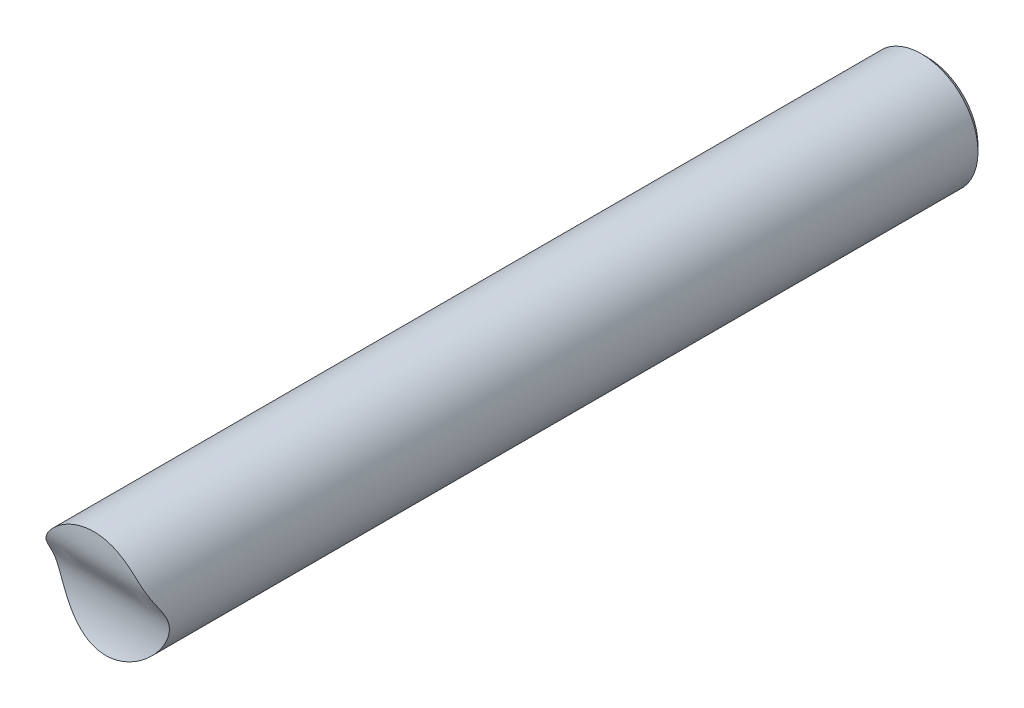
ISO-10303-21;
HEADER;
FILE_DESCRIPTION(('STEP AP214'),'2;1');
FILE_NAME('part.step','',(''),(''),'','','');
FILE_SCHEMA(('AUTOMOTIVE_DESIGN { 1 0 10303 214 1 1 1 1 }'));
ENDSEC;
DATA;
#1=APPLICATION_CONTEXT('core data for automotive mechanical design processes');
#2=APPLICATION_PROTOCOL_DEFINITION('international standard','automotive_design',2000,#1);
#3=PRODUCT_CONTEXT('',#1,'mechanical');
#4=PRODUCT('Part','Part','',(#3));
#5=PRODUCT_RELATED_PRODUCT_CATEGORY('part','',(#4));
#6=PRODUCT_DEFINITION_FORMATION('','',#4);
#7=PRODUCT_DEFINITION_CONTEXT('part definition',#1,'design');
#8=PRODUCT_DEFINITION('design','',#6,#7);
#9=PRODUCT_DEFINITION_SHAPE('','',#8);
#10=(LENGTH_UNIT() NAMED_UNIT(*) SI_UNIT(.MILLI.,.METRE.));
#11=(NAMED_UNIT(*) PLANE_ANGLE_UNIT() SI_UNIT($,.RADIAN.));
#12=(NAMED_UNIT(*) SI_UNIT($,.STERADIAN.) SOLID_ANGLE_UNIT());
#13=UNCERTAINTY_MEASURE_WITH_UNIT(LENGTH_MEASURE(1.E-05),#10,'distance_accuracy_value','');
#14=(GEOMETRIC_REPRESENTATION_CONTEXT(3) GLOBAL_UNCERTAINTY_ASSIGNED_CONTEXT((#13)) GLOBAL_UNIT_ASSIGNED_CONTEXT((#10,
#11,#12)) REPRESENTATION_CONTEXT('',''));
#15=CARTESIAN_POINT('',(0.,0.,0.));
#16=DIRECTION('',(0.,0.,1.));
#17=DIRECTION('',(1.,0.,0.));
#18=AXIS2_PLACEMENT_3D('',#15,#16,#17);
#19=CARTESIAN_POINT('',(0.,0.,300.));
#20=DIRECTION('',(0.,0.,-1.));
#21=DIRECTION('',(-1.,0.,0.));
#22=AXIS2_PLACEMENT_3D('',#19,#20,#21);
#23=CYLINDRICAL_SURFACE('',#22,20.);
#24=CARTESIAN_POINT('',(0.,0.,1.99999999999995));
#25=DIRECTION('',(0.,0.,1.));
#26=DIRECTION('',(1.,0.,0.));
#27=AXIS2_PLACEMENT_3D('',#24,#25,#26);
#28=CIRCLE('',#27,20.);
#29=CARTESIAN_POINT('',(20.,0.,1.99999999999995));
#30=VERTEX_POINT('',#29);
#31=EDGE_CURVE('E39',#30,#30,#28,.T.);
#32=ORIENTED_EDGE('',*,*,#31,.T.);
#33=EDGE_LOOP('',(#32));
#34=FACE_BOUND('',#33,.T.);
#35=CARTESIAN_POINT('',(-20.,0.,288.275015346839));
#36=CARTESIAN_POINT('',(-20.0000030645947,0.381439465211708,288.437177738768));
#37=CARTESIAN_POINT('',(-19.989101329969,0.756285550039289,288.615006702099));
#38=CARTESIAN_POINT('',(-19.9475375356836,1.49424268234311,288.992565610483));
#39=CARTESIAN_POINT('',(-19.9168355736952,1.85732847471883,289.192339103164));
#40=CARTESIAN_POINT('',(-19.83689410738,2.57448567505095,289.604971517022));
#41=CARTESIAN_POINT('',(-19.7876280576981,2.92854339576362,289.817848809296));
#42=CARTESIAN_POINT('',(-19.6705209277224,3.63304827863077,290.250115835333));
#43=CARTESIAN_POINT('',(-19.6025492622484,3.98345138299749,290.469541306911));
#44=CARTESIAN_POINT('',(-19.4477872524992,4.68091347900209,290.9058795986));
#45=CARTESIAN_POINT('',(-19.3610253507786,5.02797670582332,291.122795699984));
#46=CARTESIAN_POINT('',(-19.1674279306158,5.72182737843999,291.547604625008));
#47=CARTESIAN_POINT('',(-19.0606051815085,6.068614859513,291.755503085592));
#48=CARTESIAN_POINT('',(-18.8652706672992,6.64530052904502,292.087795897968));
#49=CARTESIAN_POINT('',(-18.7829107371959,6.87478923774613,292.216517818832));
#50=CARTESIAN_POINT('',(-18.6081795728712,7.33458673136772,292.465618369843));
#51=CARTESIAN_POINT('',(-18.5158062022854,7.56489568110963,292.585995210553));
#52=CARTESIAN_POINT('',(-18.3205880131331,8.02612933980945,292.816780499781));
#53=CARTESIAN_POINT('',(-18.2177421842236,8.25705410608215,292.92718798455));
#54=CARTESIAN_POINT('',(-18.0019283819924,8.71749940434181,293.135953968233));
#55=CARTESIAN_POINT('',(-17.8890305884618,8.94701930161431,293.234386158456));
#56=CARTESIAN_POINT('',(-17.6523312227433,9.40540834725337,293.41896562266));
#57=CARTESIAN_POINT('',(-17.5285299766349,9.63427751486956,293.505113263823));
#58=CARTESIAN_POINT('',(-17.3346823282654,9.97627021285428,293.624584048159));
#59=CARTESIAN_POINT('',(-17.2687173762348,10.0900354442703,293.662778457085));
#60=CARTESIAN_POINT('',(-17.1340735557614,10.3170215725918,293.735886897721));
#61=CARTESIAN_POINT('',(-17.0653945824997,10.4302424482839,293.770800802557));
#62=CARTESIAN_POINT('',(-16.890032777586,10.7129227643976,293.854107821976));
#63=CARTESIAN_POINT('',(-16.7816509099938,10.8819491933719,293.900419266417));
#64=CARTESIAN_POINT('',(-16.5589278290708,11.2179559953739,293.985558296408));
#65=CARTESIAN_POINT('',(-16.4445861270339,11.3849361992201,294.024385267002));
#66=CARTESIAN_POINT('',(-16.2101531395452,11.7163192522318,294.095354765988));
#67=CARTESIAN_POINT('',(-16.0900603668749,11.8807214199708,294.127495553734));
#68=CARTESIAN_POINT('',(-15.8443964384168,12.2064218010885,294.18593062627));
#69=CARTESIAN_POINT('',(-15.7188252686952,12.3677200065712,294.212224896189));
#70=CARTESIAN_POINT('',(-15.3329273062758,12.8479745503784,294.283703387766));
#71=CARTESIAN_POINT('',(-15.0645567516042,13.1616758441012,294.321153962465));
#72=CARTESIAN_POINT('',(-14.5081618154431,13.7725833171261,294.380607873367));
#73=CARTESIAN_POINT('',(-14.2201365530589,14.0697887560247,294.402610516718));
#74=CARTESIAN_POINT('',(-13.7267747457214,14.5482100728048,294.429645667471));
#75=CARTESIAN_POINT('',(-13.5265533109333,14.7345559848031,294.437903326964));
#76=CARTESIAN_POINT('',(-13.1185648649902,15.0989432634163,294.450364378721));
#77=CARTESIAN_POINT('',(-12.9107974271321,15.2769841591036,294.454567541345));
#78=CARTESIAN_POINT('',(-12.2766992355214,15.7981620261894,294.462359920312));
#79=CARTESIAN_POINT('',(-11.8395592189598,16.128367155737,294.461132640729));
#80=CARTESIAN_POINT('',(-10.9402766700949,16.7513998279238,294.451083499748));
#81=CARTESIAN_POINT('',(-10.4781603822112,17.0442655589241,294.442269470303));
#82=CARTESIAN_POINT('',(-9.53158545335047,17.5911220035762,294.420850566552));
#83=CARTESIAN_POINT('',(-9.04712840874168,17.845115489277,294.408245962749));
#84=CARTESIAN_POINT('',(-8.05571231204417,18.3141551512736,294.381929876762));
#85=CARTESIAN_POINT('',(-7.5486227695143,18.5289250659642,294.368211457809));
#86=CARTESIAN_POINT('',(-6.5184331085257,18.9159402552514,294.341752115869));
#87=CARTESIAN_POINT('',(-5.99533275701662,19.088184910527,294.32901120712));
#88=CARTESIAN_POINT('',(-4.93658716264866,19.3889917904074,294.305881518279));
#89=CARTESIAN_POINT('',(-4.40094017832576,19.5175479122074,294.295493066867));
#90=CARTESIAN_POINT('',(-3.3208143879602,19.7300571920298,294.277958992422));
#91=CARTESIAN_POINT('',(-2.77633550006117,19.8140099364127,294.270813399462));
#92=CARTESIAN_POINT('',(-1.67083793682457,19.9380061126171,294.260170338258));
#93=CARTESIAN_POINT('',(-1.109711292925,19.9770960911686,294.256752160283));
#94=CARTESIAN_POINT('',(0.0138573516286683,20.0078898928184,294.254064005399));
#95=CARTESIAN_POINT('',(0.576299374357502,19.9995929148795,294.254794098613));
#96=CARTESIAN_POINT('',(1.69836534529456,19.9356784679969,294.26035393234));
#97=CARTESIAN_POINT('',(2.25798978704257,19.8800695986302,294.265182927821));
#98=CARTESIAN_POINT('',(3.37052159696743,19.7219487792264,294.278604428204));
#99=CARTESIAN_POINT('',(3.92342902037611,19.619437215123,294.287196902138));
#100=CARTESIAN_POINT('',(5.01681616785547,19.3686637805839,294.307430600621));
#101=CARTESIAN_POINT('',(5.55733043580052,19.2205516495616,294.319061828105));
#102=CARTESIAN_POINT('',(6.62399426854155,18.8795182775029,294.344268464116));
#103=CARTESIAN_POINT('',(7.15014370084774,18.6865966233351,294.357843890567));
#104=CARTESIAN_POINT('',(8.18495008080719,18.2570753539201,294.385252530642));
#105=CARTESIAN_POINT('',(8.69358741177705,18.0204285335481,294.399086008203));
#106=CARTESIAN_POINT('',(9.68926883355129,17.5052044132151,294.424543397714));
#107=CARTESIAN_POINT('',(10.1763134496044,17.2266281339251,294.436167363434));
#108=CARTESIAN_POINT('',(10.9689025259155,16.7279570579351,294.450827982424));
#109=CARTESIAN_POINT('',(11.2813789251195,16.5188321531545,294.455432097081));
#110=CARTESIAN_POINT('',(11.8941090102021,16.0832653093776,294.460701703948));
#111=CARTESIAN_POINT('',(12.1943621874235,15.8568226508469,294.461367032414));
#112=CARTESIAN_POINT('',(12.781670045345,15.3873418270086,294.457080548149));
#113=CARTESIAN_POINT('',(13.0687218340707,15.1443000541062,294.452127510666));
#114=CARTESIAN_POINT('',(13.6280150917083,14.6430166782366,294.434540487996));
#115=CARTESIAN_POINT('',(13.9002839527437,14.3848051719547,294.42192127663));
#116=CARTESIAN_POINT('',(14.4295098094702,13.8538701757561,294.386463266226));
#117=CARTESIAN_POINT('',(14.6864694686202,13.5811492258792,294.363626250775));
#118=CARTESIAN_POINT('',(15.1839610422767,13.0225606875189,294.304587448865));
#119=CARTESIAN_POINT('',(15.4244981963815,12.7366973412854,294.268389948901));
#120=CARTESIAN_POINT('',(15.8206669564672,12.2383162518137,294.191734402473));
#121=CARTESIAN_POINT('',(15.9806717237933,12.0286036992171,294.155565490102));
#122=CARTESIAN_POINT('',(16.2913178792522,11.6043962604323,294.072880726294));
#123=CARTESIAN_POINT('',(16.4419621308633,11.3899028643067,294.026368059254));
#124=CARTESIAN_POINT('',(16.7333562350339,10.9573173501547,293.921047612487));
#125=CARTESIAN_POINT('',(16.8741088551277,10.7392262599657,293.862243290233));
#126=CARTESIAN_POINT('',(17.1449377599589,10.3013171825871,293.732380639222));
#127=CARTESIAN_POINT('',(17.2750528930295,10.0815090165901,293.661370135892));
#128=CARTESIAN_POINT('',(17.5251120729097,9.64026875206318,293.507183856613));
#129=CARTESIAN_POINT('',(17.6450523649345,9.41883608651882,293.424003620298));
#130=CARTESIAN_POINT('',(17.8747267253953,8.9753285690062,293.246121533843));
#131=CARTESIAN_POINT('',(17.9844606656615,8.75325370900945,293.151419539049));
#132=CARTESIAN_POINT('',(18.2306654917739,8.23121159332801,292.916322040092));
#133=CARTESIAN_POINT('',(18.3630052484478,7.93125847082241,292.771554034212));
#134=CARTESIAN_POINT('',(18.6102412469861,7.33239258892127,292.465711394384));
#135=CARTESIAN_POINT('',(18.7251296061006,7.03348035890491,292.304629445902));
#136=CARTESIAN_POINT('',(18.938515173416,6.43685229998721,291.969815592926));
#137=CARTESIAN_POINT('',(19.0370082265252,6.13913679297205,291.796080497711));
#138=CARTESIAN_POINT('',(19.2194787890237,5.54166836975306,291.438382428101));
#139=CARTESIAN_POINT('',(19.303321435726,5.24192048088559,291.254343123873));
#140=CARTESIAN_POINT('',(19.4563796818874,4.64168054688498,290.881742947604));
#141=CARTESIAN_POINT('',(19.5256000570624,4.34118877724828,290.693183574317));
#142=CARTESIAN_POINT('',(19.6501161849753,3.73737897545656,290.315873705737));
#143=CARTESIAN_POINT('',(19.7054097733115,3.43406051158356,290.127123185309));
#144=CARTESIAN_POINT('',(19.7916783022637,2.88928106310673,289.794969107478));
#145=CARTESIAN_POINT('',(19.8253270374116,2.64879014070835,289.650671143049));
#146=CARTESIAN_POINT('',(19.8841120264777,2.16374029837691,289.367373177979));
#147=CARTESIAN_POINT('',(19.9092503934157,1.91918240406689,289.228371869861));
#148=CARTESIAN_POINT('',(19.9507123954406,1.42497167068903,288.958304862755));
#149=CARTESIAN_POINT('',(19.9670372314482,1.17531953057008,288.827238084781));
#150=CARTESIAN_POINT('',(19.9844874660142,0.797480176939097,288.639267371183));
#151=CARTESIAN_POINT('',(19.9891267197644,0.671479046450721,288.578273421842));
#152=CARTESIAN_POINT('',(19.9960337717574,0.417988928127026,288.459310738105));
#153=CARTESIAN_POINT('',(19.9983016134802,0.290499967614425,288.401341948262));
#154=CARTESIAN_POINT('',(20.0003822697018,0.033980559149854,288.288836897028));
#155=CARTESIAN_POINT('',(20.0001948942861,-0.0950500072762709,288.234300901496));
#156=CARTESIAN_POINT('',(19.9972783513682,-0.354543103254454,288.128832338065));
#157=CARTESIAN_POINT('',(19.9945491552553,-0.485005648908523,288.077899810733));
#158=CARTESIAN_POINT('',(19.9824274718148,-0.878256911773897,287.930494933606));
#159=CARTESIAN_POINT('',(19.9691014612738,-1.14297019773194,287.839388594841));
#160=CARTESIAN_POINT('',(19.9312152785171,-1.67921587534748,287.670480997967));
#161=CARTESIAN_POINT('',(19.9065253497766,-1.95079182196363,287.592848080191));
#162=CARTESIAN_POINT('',(19.8454850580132,-2.49641725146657,287.451844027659));
#163=CARTESIAN_POINT('',(19.8091309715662,-2.77046749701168,287.388477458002));
#164=CARTESIAN_POINT('',(19.7245442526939,-3.3195672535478,287.275510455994));
#165=CARTESIAN_POINT('',(19.6763112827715,-3.59461679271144,287.225910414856));
#166=CARTESIAN_POINT('',(19.5676015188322,-4.14588127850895,287.139542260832));
#167=CARTESIAN_POINT('',(19.5070599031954,-4.42209448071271,287.102845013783));
#168=CARTESIAN_POINT('',(19.3739524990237,-4.97295073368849,287.041814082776));
#169=CARTESIAN_POINT('',(19.3013877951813,-5.24759392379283,287.017479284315));
#170=CARTESIAN_POINT('',(19.14439565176,-5.79422364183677,286.98023107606));
#171=CARTESIAN_POINT('',(19.0599680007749,-6.06621012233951,286.967317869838));
#172=CARTESIAN_POINT('',(18.8195227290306,-6.78601876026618,286.946819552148));
#173=CARTESIAN_POINT('',(18.6531853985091,-7.23071365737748,286.948461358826));
#174=CARTESIAN_POINT('',(18.2896308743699,-8.10644142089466,286.976018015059));
#175=CARTESIAN_POINT('',(18.0924086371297,-8.537472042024,287.001936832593));
#176=CARTESIAN_POINT('',(17.668813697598,-9.38276727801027,287.073531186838));
#177=CARTESIAN_POINT('',(17.4424648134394,-9.79704523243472,287.119190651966));
#178=CARTESIAN_POINT('',(16.9620850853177,-10.6070461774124,287.226095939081));
#179=CARTESIAN_POINT('',(16.7080550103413,-11.0027696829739,287.287341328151));
#180=CARTESIAN_POINT('',(16.1694463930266,-11.7803372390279,287.42271968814));
#181=CARTESIAN_POINT('',(15.8844348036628,-12.1618467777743,287.49704772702));
#182=CARTESIAN_POINT('',(15.2889170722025,-12.9025130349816,287.654250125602));
#183=CARTESIAN_POINT('',(14.9784110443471,-13.2616698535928,287.737124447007));
#184=CARTESIAN_POINT('',(14.3332623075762,-13.9564455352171,287.908208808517));
#185=CARTESIAN_POINT('',(13.9986123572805,-14.2920572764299,287.996420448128));
#186=CARTESIAN_POINT('',(13.3067445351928,-14.9383632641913,288.175684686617));
#187=CARTESIAN_POINT('',(12.9495246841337,-15.2490553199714,288.266737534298));
#188=CARTESIAN_POINT('',(12.1471480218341,-15.898406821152,288.465907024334));
#189=CARTESIAN_POINT('',(11.6978080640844,-16.2318875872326,288.574117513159));
#190=CARTESIAN_POINT('',(10.7722118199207,-16.8603804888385,288.787391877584));
#191=CARTESIAN_POINT('',(10.295952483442,-17.1553882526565,288.892455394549));
#192=CARTESIAN_POINT('',(9.31901229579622,-17.7050930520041,289.095697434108));
#193=CARTESIAN_POINT('',(8.81832052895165,-17.9597718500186,289.193872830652));
#194=CARTESIAN_POINT('',(7.79557074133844,-18.4267451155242,289.379525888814));
#195=CARTESIAN_POINT('',(7.27351448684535,-18.6390430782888,289.467004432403));
#196=CARTESIAN_POINT('',(6.47464189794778,-18.9251171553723,289.587800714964));
#197=CARTESIAN_POINT('',(6.20444782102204,-19.0154170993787,289.626481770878));
#198=CARTESIAN_POINT('',(5.66001029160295,-19.18451266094,289.699743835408));
#199=CARTESIAN_POINT('',(5.38576783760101,-19.2633110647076,289.734325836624));
#200=CARTESIAN_POINT('',(4.55754392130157,-19.4821644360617,289.831300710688));
#201=CARTESIAN_POINT('',(3.99800050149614,-19.6047010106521,289.886932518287));
#202=CARTESIAN_POINT('',(2.86940561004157,-19.8013738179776,289.977204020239));
#203=CARTESIAN_POINT('',(2.30036361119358,-19.8755556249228,290.011863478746));
#204=CARTESIAN_POINT('',(1.15707921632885,-19.9747403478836,290.058375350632));
#205=CARTESIAN_POINT('',(0.582837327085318,-19.9997480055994,290.070229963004));
#206=CARTESIAN_POINT('',(-0.515281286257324,-20.0002263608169,290.070459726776));
#207=CARTESIAN_POINT('',(-1.039161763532,-19.979846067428,290.060801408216));
#208=CARTESIAN_POINT('',(-2.08298666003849,-19.8981201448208,290.022422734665));
#209=CARTESIAN_POINT('',(-2.60293129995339,-19.8367768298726,289.993703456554));
#210=CARTESIAN_POINT('',(-3.63527766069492,-19.6737882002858,289.918515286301));
#211=CARTESIAN_POINT('',(-4.14767733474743,-19.5721321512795,289.872041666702));
#212=CARTESIAN_POINT('',(-5.16138238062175,-19.3295568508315,289.763367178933));
#213=CARTESIAN_POINT('',(-5.66268743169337,-19.1886364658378,289.701165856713));
#214=CARTESIAN_POINT('',(-6.64667275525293,-18.8702609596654,289.56416130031));
#215=CARTESIAN_POINT('',(-7.12948026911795,-18.693146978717,289.489476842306));
#216=CARTESIAN_POINT('',(-8.0787767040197,-18.3029192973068,289.329791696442));
#217=CARTESIAN_POINT('',(-8.54525860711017,-18.0897903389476,289.244786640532));
#218=CARTESIAN_POINT('',(-9.45941450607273,-17.6289966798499,289.067300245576));
#219=CARTESIAN_POINT('',(-9.9070861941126,-17.3813277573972,288.974817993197));
#220=CARTESIAN_POINT('',(-10.7814583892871,-16.8529258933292,288.785243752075));
#221=CARTESIAN_POINT('',(-11.2081578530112,-16.5721913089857,288.688151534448));
#222=CARTESIAN_POINT('',(-12.0762224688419,-15.9522575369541,288.483348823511));
#223=CARTESIAN_POINT('',(-12.5154135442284,-15.6100657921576,288.375473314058));
#224=CARTESIAN_POINT('',(-13.3640799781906,-14.8899639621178,288.161394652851));
#225=CARTESIAN_POINT('',(-13.7735520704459,-14.5120499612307,288.055191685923));
#226=CARTESIAN_POINT('',(-14.3634957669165,-13.9200452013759,287.900130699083));
#227=CARTESIAN_POINT('',(-14.5561234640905,-13.7184930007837,287.849144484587));
#228=CARTESIAN_POINT('',(-14.9330104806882,-13.3072535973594,287.749108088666));
#229=CARTESIAN_POINT('',(-15.1172697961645,-13.0975663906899,287.700057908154));
#230=CARTESIAN_POINT('',(-15.6569825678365,-12.4567519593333,287.556804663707));
#231=CARTESIAN_POINT('',(-15.9995273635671,-12.0137149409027,287.466456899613));
#232=CARTESIAN_POINT('',(-16.5956119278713,-11.171730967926,287.315036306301));
#233=CARTESIAN_POINT('',(-16.8546249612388,-10.7770637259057,287.25159241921));
#234=CARTESIAN_POINT('',(-17.3449428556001,-9.96876865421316,287.139866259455));
#235=CARTESIAN_POINT('',(-17.5762485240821,-9.55514137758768,287.091583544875));
#236=CARTESIAN_POINT('',(-18.0093603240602,-8.71134277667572,287.01438849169));
#237=CARTESIAN_POINT('',(-18.2111944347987,-8.28118764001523,286.985457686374));
#238=CARTESIAN_POINT('',(-18.490741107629,-7.6255487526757,286.959906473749));
#239=CARTESIAN_POINT('',(-18.5800516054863,-7.40528060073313,286.954363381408));
#240=CARTESIAN_POINT('',(-18.750811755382,-6.96157851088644,286.949799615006));
#241=CARTESIAN_POINT('',(-18.8322593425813,-6.73814375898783,286.950780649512));
#242=CARTESIAN_POINT('',(-19.0353548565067,-6.14850357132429,286.962685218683));
#243=CARTESIAN_POINT('',(-19.1504225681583,-5.78010196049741,286.979423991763));
#244=CARTESIAN_POINT('',(-19.3586886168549,-5.03878688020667,287.03410139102));
#245=CARTESIAN_POINT('',(-19.4518917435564,-4.66587441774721,287.072035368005));
#246=CARTESIAN_POINT('',(-19.6160225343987,-3.91888384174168,287.171281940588));
#247=CARTESIAN_POINT('',(-19.6869865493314,-3.54480865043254,287.232556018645));
#248=CARTESIAN_POINT('',(-19.8068885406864,-2.79820565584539,287.380370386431));
#249=CARTESIAN_POINT('',(-19.8558365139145,-2.42567722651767,287.466899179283));
#250=CARTESIAN_POINT('',(-19.9121183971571,-1.88107687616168,287.613777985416));
#251=CARTESIAN_POINT('',(-19.9277794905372,-1.70700222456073,287.663833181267));
#252=CARTESIAN_POINT('',(-19.954440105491,-1.36033539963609,287.769930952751));
#253=CARTESIAN_POINT('',(-19.9654401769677,-1.18774305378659,287.825972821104));
#254=CARTESIAN_POINT('',(-19.9828945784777,-0.844632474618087,287.944016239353));
#255=CARTESIAN_POINT('',(-19.9893548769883,-0.674111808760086,288.006009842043));
#256=CARTESIAN_POINT('',(-19.9979065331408,-0.33530630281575,288.136006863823));
#257=CARTESIAN_POINT('',(-19.9999986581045,-0.167021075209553,288.204009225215));
#258=CARTESIAN_POINT('',(-20.,0.,288.275015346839));
#259=B_SPLINE_CURVE_WITH_KNOTS('',3,(#35,#36,#37,#38,#39,#40,#41,#42,#43,#44,#45,#46,#47,#48,
#49,#50,#51,#52,#53,#54,#55,#56,#57,#58,#59,#60,#61,#62,#63,#64,#65,#66,#67,#68,#69,#70,#71,#72,
#73,#74,#75,#76,#77,#78,#79,#80,#81,#82,#83,#84,#85,#86,#87,#88,#89,#90,#91,#92,#93,#94,#95,#96,
#97,#98,#99,#100,#101,#102,#103,#104,#105,#106,#107,#108,#109,#110,#111,#112,#113,#114,#115,
#116,#117,#118,#119,#120,#121,#122,#123,#124,#125,#126,#127,#128,#129,#130,#131,#132,#133,#134,
#135,#136,#137,#138,#139,#140,#141,#142,#143,#144,#145,#146,#147,#148,#149,#150,#151,#152,#153,
#154,#155,#156,#157,#158,#159,#160,#161,#162,#163,#164,#165,#166,#167,#168,#169,#170,#171,#172,
#173,#174,#175,#176,#177,#178,#179,#180,#181,#182,#183,#184,#185,#186,#187,#188,#189,#190,#191,
#192,#193,#194,#195,#196,#197,#198,#199,#200,#201,#202,#203,#204,#205,#206,#207,#208,#209,#210,
#211,#212,#213,#214,#215,#216,#217,#218,#219,#220,#221,#222,#223,#224,#225,#226,#227,#228,#229,
#230,#231,#232,#233,#234,#235,#236,#237,#238,#239,#240,#241,#242,#243,#244,#245,#246,#247,#248,
#249,#250,#251,#252,#253,#254,#255,#256,#257,#258),.UNSPECIFIED.,.T.,.F.,(4,2,2,2,2,2,2,2,2,2,2,
2,2,2,2,2,2,2,2,2,2,2,2,2,2,2,2,2,2,2,2,2,2,2,2,2,2,2,2,2,2,2,2,2,2,2,2,2,2,2,2,2,2,2,2,2,2,2,2,
2,2,2,2,2,2,2,2,2,2,2,2,2,2,2,2,2,2,2,2,2,2,2,2,2,2,2,2,2,2,2,2,2,2,2,2,2,2,2,2,2,2,2,2,2,2,2,2,
2,2,2,2,4),(0.,1.24329413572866,2.4891016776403,3.73669743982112,4.99323392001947,
6.24788152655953,7.50173320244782,8.32860994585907,9.15566345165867,9.98279682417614,
10.804550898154,11.626280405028,12.0370447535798,12.4478249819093,13.0657613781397,
13.6837485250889,14.3018963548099,14.920045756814,16.1623402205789,17.4046903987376,
18.2253720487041,19.0461001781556,20.6875006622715,22.327208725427,23.9667998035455,
25.6175275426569,27.2682793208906,28.9192615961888,30.5702591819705,32.255730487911,
33.9412302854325,35.6264237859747,37.311603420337,38.9913073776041,40.6710268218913,
42.3525703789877,44.0340730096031,45.1615952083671,46.2891642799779,47.4169791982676,
48.5426275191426,49.6680794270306,50.793170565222,51.5915682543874,52.3897204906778,
53.1876485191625,53.9825185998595,54.7776807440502,55.5728528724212,56.6470745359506,
57.7217799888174,58.7967573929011,59.8811614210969,60.9652107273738,62.0494284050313,
62.8966706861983,63.7437024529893,64.5906187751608,65.0107623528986,65.430898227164,
65.8510665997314,66.2712397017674,67.1113866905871,67.9613742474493,68.8116334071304,
69.661916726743,70.5167996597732,71.3716055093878,72.2264265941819,73.6486846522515,
75.0711752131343,76.4925098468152,77.9138050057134,79.3584334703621,80.8030554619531,
82.2481125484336,83.6932965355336,85.4011196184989,87.1091365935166,88.8179237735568,
90.5265699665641,91.3888127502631,92.2508463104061,93.9747035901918,95.6969337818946,
97.4189978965,98.9901529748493,100.561219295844,102.132704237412,103.704234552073,
105.261584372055,106.819595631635,108.377797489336,109.936076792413,111.635543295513,
113.335196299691,114.185247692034,115.035299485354,116.73472832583,118.162381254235,
119.589992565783,121.016239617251,121.729284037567,122.442515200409,123.60023895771,
124.757708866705,125.913276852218,127.068319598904,127.613599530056,128.158815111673,
128.703312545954,129.247714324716),.UNSPECIFIED.);
#260=CARTESIAN_POINT('',(-20.,0.,288.275015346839));
#261=VERTEX_POINT('',#260);
#262=EDGE_CURVE('E10',#261,#261,#259,.T.);
#263=ORIENTED_EDGE('',*,*,#262,.T.);
#264=EDGE_LOOP('',(#263));
#265=FACE_BOUND('',#264,.T.);
#266=ADVANCED_FACE('F25',(#34,#265),#23,.T.);
#267=CARTESIAN_POINT('',(0.,0.,0.));
#268=DIRECTION('',(0.,0.,1.));
#269=DIRECTION('',(1.,0.,0.));
#270=AXIS2_PLACEMENT_3D('',#267,#268,#269);
#271=PLANE('',#270);
#272=CARTESIAN_POINT('',(0.,0.,0.));
#273=DIRECTION('',(0.,0.,1.));
#274=DIRECTION('',(1.,0.,0.));
#275=AXIS2_PLACEMENT_3D('',#272,#273,#274);
#276=CIRCLE('',#275,18.0000000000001);
#277=CARTESIAN_POINT('',(18.0000000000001,0.,0.));
#278=VERTEX_POINT('',#277);
#279=EDGE_CURVE('E35',#278,#278,#276,.F.);
#280=ORIENTED_EDGE('',*,*,#279,.T.);
#281=EDGE_LOOP('',(#280));
#282=FACE_BOUND('',#281,.T.);
#283=ADVANCED_FACE('F58',(#282),#271,.F.);
#284=CARTESIAN_POINT('',(0.,0.,1.99999999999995));
#285=DIRECTION('',(0.,0.,1.));
#286=DIRECTION('',(1.,0.,0.));
#287=AXIS2_PLACEMENT_3D('',#284,#285,#286);
#288=CONICAL_SURFACE('',#287,20.,0.785398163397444);
#289=ORIENTED_EDGE('',*,*,#279,.F.);
#290=EDGE_LOOP('',(#289));
#291=FACE_BOUND('',#290,.T.);
#292=ORIENTED_EDGE('',*,*,#31,.F.);
#293=EDGE_LOOP('',(#292));
#294=FACE_BOUND('',#293,.T.);
#295=ADVANCED_FACE('F55',(#291,#294),#288,.T.);
#296=CARTESIAN_POINT('',(-20.,29.6473017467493,293.967297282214));
#297=CARTESIAN_POINT('',(-20.,35.9226201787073,296.453422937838));
#298=CARTESIAN_POINT('',(-20.,0.776097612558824,333.058026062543));
#299=CARTESIAN_POINT('',(-20.,-38.9667281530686,299.166156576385));
#300=CARTESIAN_POINT('',(-20.,-14.4602772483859,286.666001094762));
#301=CARTESIAN_POINT('',(-20.,0.318913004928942,286.540327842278));
#302=CARTESIAN_POINT('',(-20.,11.4383909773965,297.425889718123));
#303=CARTESIAN_POINT('',(-20.,26.5656727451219,292.746432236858));
#304=CARTESIAN_POINT('',(-20.,29.6473017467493,293.967297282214));
#305=B_SPLINE_CURVE_WITH_KNOTS('',3,(#296,#297,#298,#299,#300,#301,#302,#303,#304),
.UNSPECIFIED.,.T.,.F.,(4,1,1,1,1,1,4),(0.,0.282188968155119,0.540163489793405,0.666339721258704,
0.76766832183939,0.861425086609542,1.),.UNSPECIFIED.);
#306=DIRECTION('',(1.,0.,0.));
#307=VECTOR('',#306,1.);
#308=SURFACE_OF_LINEAR_EXTRUSION('',#305,#307);
#309=ORIENTED_EDGE('',*,*,#262,.F.);
#310=EDGE_LOOP('',(#309));
#311=FACE_BOUND('',#310,.T.);
#312=ADVANCED_FACE('F51',(#311),#308,.F.);
#313=CLOSED_SHELL('',(#266,#283,#295,#312));
#314=MANIFOLD_SOLID_BREP('B2',#313);
#315=ADVANCED_BREP_SHAPE_REPRESENTATION('',(#18,#314),#14);
#316=SHAPE_DEFINITION_REPRESENTATION(#9,#315);
ENDSEC;
END-ISO-10303-21;
